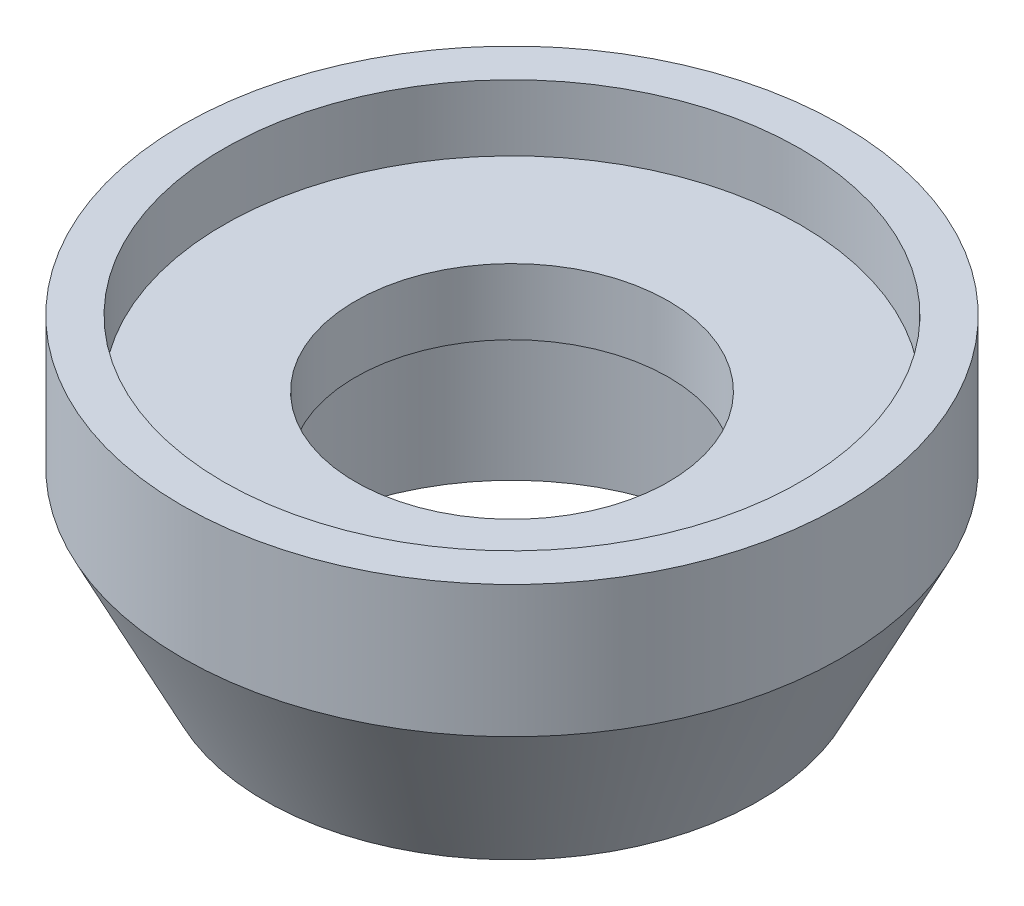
from build123d import *


with BuildPart() as part:
    # Esquisse1 → R_volution2 (revolve)
    with BuildSketch(Plane.XY, mode=Mode.PRIVATE) as r_volution2_sk:
        Polygon((-13.2, 7.677034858), (-13.2, 17.677034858), (-9.5, 17.677034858), (-9.5, 21.677034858), (-17.5, 21.677034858), (-17.5, 25.677034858), (-20, 25.677034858), (-20, 17.677034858), (-15, 7.677034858), align=None)
    revolve(r_volution2_sk.sketch.rotate(Axis((0, 0, 0), (0, 1, 0)), 270), axis=Axis((0, 0, 0), (0, 1, 0)))


solid = part.part
